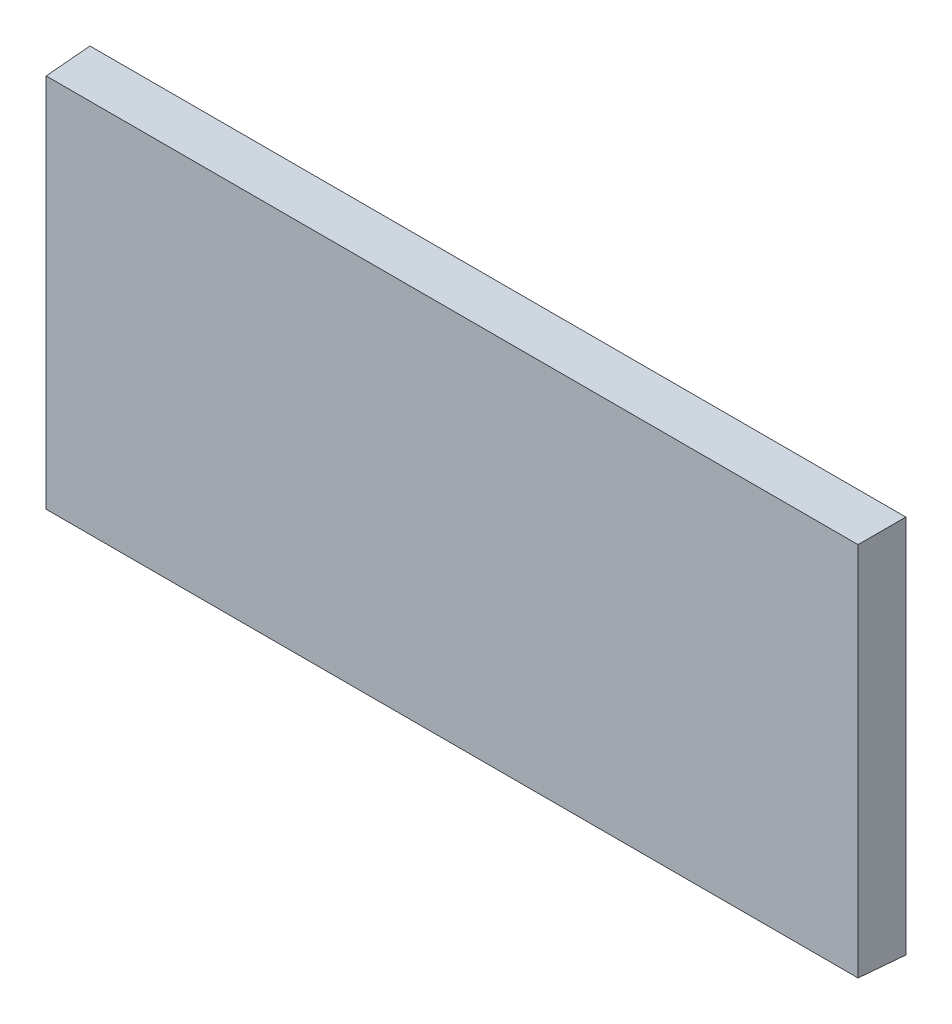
from build123d import *

# Parameters (mm, degrees)
SKETCH3_W      = 119
SKETCH3_H      = 55.32
EXTRUDE2_DEPTH = 6.68
EXTRUDE2_TAPER = 2.5
SHELL4_T       = -2


with BuildPart() as part:
    # Sketch3 → Extrude2 (new body)
    with BuildSketch(Plane.XY):
        with Locations((59.5, 27.66)):
            Rectangle(SKETCH3_W, SKETCH3_H)
    extrude(amount=EXTRUDE2_DEPTH, taper=EXTRUDE2_TAPER)

    # Shell4
    shell4_openings = [part.faces().sort_by_distance(p)[0] for p in [
        (59.5, 27.66, 0),
    ]]
    offset(amount=SHELL4_T, openings=shell4_openings, kind=Kind.INTERSECTION)


solid = part.part
